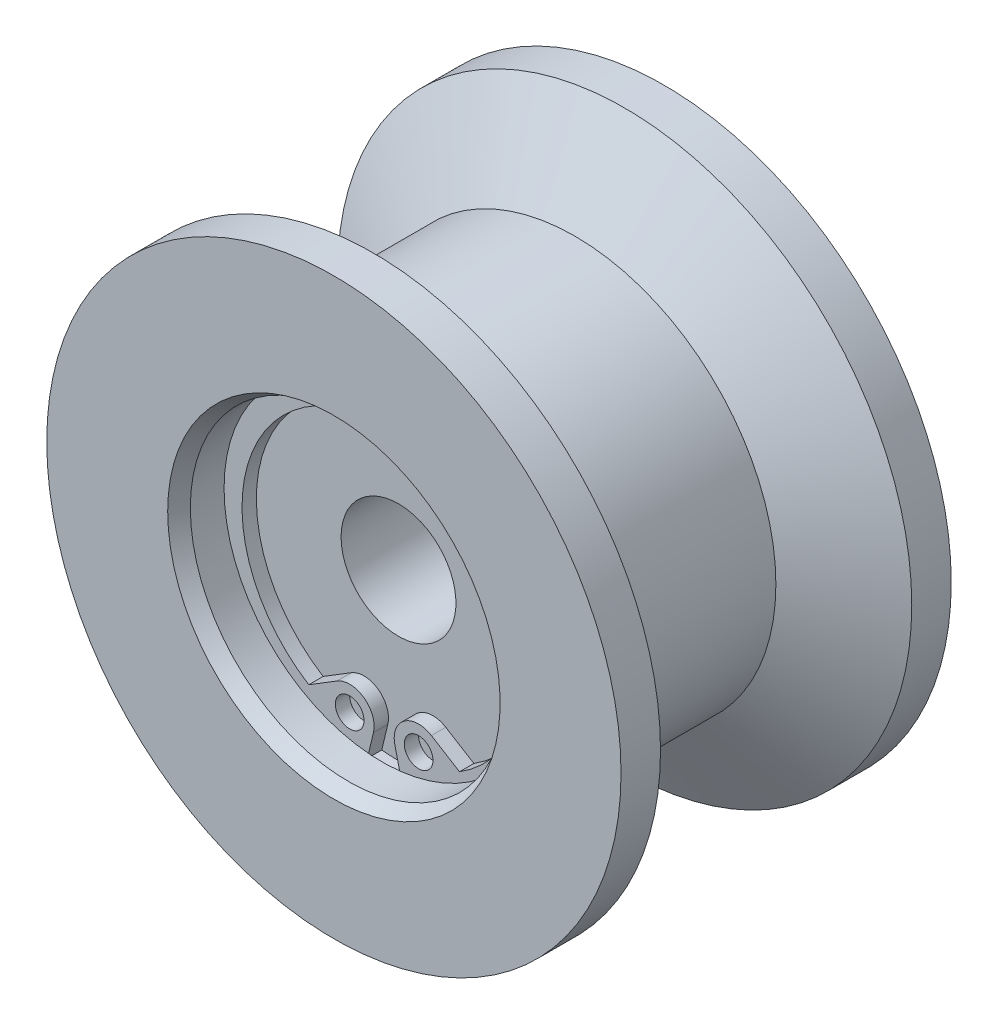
ISO-10303-21;
HEADER;
FILE_DESCRIPTION(('STEP AP214'),'2;1');
FILE_NAME('part.step','',(''),(''),'','','');
FILE_SCHEMA(('AUTOMOTIVE_DESIGN { 1 0 10303 214 1 1 1 1 }'));
ENDSEC;
DATA;
#1=APPLICATION_CONTEXT('core data for automotive mechanical design processes');
#2=APPLICATION_PROTOCOL_DEFINITION('international standard','automotive_design',2000,#1);
#3=PRODUCT_CONTEXT('',#1,'mechanical');
#4=PRODUCT('Part','Part','',(#3));
#5=PRODUCT_RELATED_PRODUCT_CATEGORY('part','',(#4));
#6=PRODUCT_DEFINITION_FORMATION('','',#4);
#7=PRODUCT_DEFINITION_CONTEXT('part definition',#1,'design');
#8=PRODUCT_DEFINITION('design','',#6,#7);
#9=PRODUCT_DEFINITION_SHAPE('','',#8);
#10=(LENGTH_UNIT() NAMED_UNIT(*) SI_UNIT(.MILLI.,.METRE.));
#11=(NAMED_UNIT(*) PLANE_ANGLE_UNIT() SI_UNIT($,.RADIAN.));
#12=(NAMED_UNIT(*) SI_UNIT($,.STERADIAN.) SOLID_ANGLE_UNIT());
#13=UNCERTAINTY_MEASURE_WITH_UNIT(LENGTH_MEASURE(1.E-05),#10,'distance_accuracy_value','');
#14=(GEOMETRIC_REPRESENTATION_CONTEXT(3) GLOBAL_UNCERTAINTY_ASSIGNED_CONTEXT((#13)) GLOBAL_UNIT_ASSIGNED_CONTEXT((#10,
#11,#12)) REPRESENTATION_CONTEXT('',''));
#15=CARTESIAN_POINT('',(0.,0.,0.));
#16=DIRECTION('',(0.,0.,1.));
#17=DIRECTION('',(1.,0.,0.));
#18=AXIS2_PLACEMENT_3D('',#15,#16,#17);
#19=CARTESIAN_POINT('',(0.,-0.65,8.));
#20=DIRECTION('',(0.,0.,1.));
#21=DIRECTION('',(-1.,0.,0.));
#22=AXIS2_PLACEMENT_3D('',#19,#20,#21);
#23=CYLINDRICAL_SURFACE('',#22,9.9);
#24=CARTESIAN_POINT('',(0.,-0.65,7.));
#25=DIRECTION('',(0.,0.,1.));
#26=DIRECTION('',(1.,0.,0.));
#27=AXIS2_PLACEMENT_3D('',#24,#25,#26);
#28=CIRCLE('',#27,9.9);
#29=CARTESIAN_POINT('',(5.24892182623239,-9.04397520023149,7.));
#30=VERTEX_POINT('',#29);
#31=CARTESIAN_POINT('',(-5.24892182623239,-9.04397520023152,7.));
#32=VERTEX_POINT('',#31);
#33=EDGE_CURVE('E169',#30,#32,#28,.T.);
#34=ORIENTED_EDGE('',*,*,#33,.F.);
#35=DIRECTION('',(0.,0.,-1.));
#36=VECTOR('',#35,1.);
#37=CARTESIAN_POINT('',(5.2489218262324,-9.04397520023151,8.));
#38=LINE('',#37,#36);
#39=CARTESIAN_POINT('',(5.2489218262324,-9.04397520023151,8.));
#40=VERTEX_POINT('',#39);
#41=EDGE_CURVE('E123',#40,#30,#38,.T.);
#42=ORIENTED_EDGE('',*,*,#41,.F.);
#43=CARTESIAN_POINT('',(0.,-0.65,8.));
#44=DIRECTION('',(0.,0.,-1.));
#45=DIRECTION('',(0.,-1.,0.));
#46=AXIS2_PLACEMENT_3D('',#43,#44,#45);
#47=CIRCLE('',#46,9.9);
#48=CARTESIAN_POINT('',(-5.24892182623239,-9.04397520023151,8.));
#49=VERTEX_POINT('',#48);
#50=EDGE_CURVE('E113',#49,#40,#47,.T.);
#51=ORIENTED_EDGE('',*,*,#50,.F.);
#52=DIRECTION('',(0.,0.,-1.));
#53=VECTOR('',#52,1.);
#54=CARTESIAN_POINT('',(-5.24892182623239,-9.04397520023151,8.));
#55=LINE('',#54,#53);
#56=EDGE_CURVE('E120',#49,#32,#55,.T.);
#57=ORIENTED_EDGE('',*,*,#56,.T.);
#58=EDGE_LOOP('',(#34,#42,#51,#57));
#59=FACE_BOUND('',#58,.T.);
#60=ADVANCED_FACE('F14',(#59),#23,.F.);
#61=CARTESIAN_POINT('',(3.29136923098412,-7.83857489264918,8.));
#62=DIRECTION('',(-0.524334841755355,-0.851512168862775,0.));
#63=DIRECTION('',(-0.851512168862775,0.524334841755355,0.));
#64=AXIS2_PLACEMENT_3D('',#61,#62,#63);
#65=PLANE('',#64);
#66=DIRECTION('',(0.851512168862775,-0.524334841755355,0.));
#67=VECTOR('',#66,1.);
#68=CARTESIAN_POINT('',(-4.38077094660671,-3.11430840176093,7.));
#69=LINE('',#68,#67);
#70=CARTESIAN_POINT('',(3.29136923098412,-7.83857489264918,7.));
#71=VERTEX_POINT('',#70);
#72=EDGE_CURVE('E144',#71,#30,#69,.T.);
#73=ORIENTED_EDGE('',*,*,#72,.F.);
#74=DIRECTION('',(0.,0.,-1.));
#75=VECTOR('',#74,1.);
#76=CARTESIAN_POINT('',(3.29136923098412,-7.83857489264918,8.));
#77=LINE('',#76,#75);
#78=CARTESIAN_POINT('',(3.29136923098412,-7.83857489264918,8.));
#79=VERTEX_POINT('',#78);
#80=EDGE_CURVE('E100',#79,#71,#77,.T.);
#81=ORIENTED_EDGE('',*,*,#80,.F.);
#82=DIRECTION('',(-0.851512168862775,0.524334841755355,0.));
#83=VECTOR('',#82,1.);
#84=CARTESIAN_POINT('',(3.29136923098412,-7.83857489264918,8.));
#85=LINE('',#84,#83);
#86=EDGE_CURVE('E106',#40,#79,#85,.T.);
#87=ORIENTED_EDGE('',*,*,#86,.F.);
#88=ORIENTED_EDGE('',*,*,#41,.T.);
#89=EDGE_LOOP('',(#73,#81,#87,#88));
#90=FACE_BOUND('',#89,.T.);
#91=ADVANCED_FACE('F172',(#90),#65,.F.);
#92=CARTESIAN_POINT('',(2.4,-9.28614557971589,8.));
#93=DIRECTION('',(0.,0.,1.));
#94=DIRECTION('',(-1.,0.,0.));
#95=AXIS2_PLACEMENT_3D('',#92,#93,#94);
#96=CYLINDRICAL_SURFACE('',#95,1.7);
#97=CARTESIAN_POINT('',(2.4,-9.28614557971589,7.));
#98=DIRECTION('',(0.,0.,1.));
#99=DIRECTION('',(1.,0.,0.));
#100=AXIS2_PLACEMENT_3D('',#97,#98,#99);
#101=CIRCLE('',#100,1.7);
#102=CARTESIAN_POINT('',(0.746119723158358,-9.67943940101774,7.));
#103=VERTEX_POINT('',#102);
#104=EDGE_CURVE('E134',#71,#103,#101,.T.);
#105=ORIENTED_EDGE('',*,*,#104,.T.);
#106=DIRECTION('',(0.,0.,-1.));
#107=VECTOR('',#106,1.);
#108=CARTESIAN_POINT('',(0.746119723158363,-9.67943940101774,8.));
#109=LINE('',#108,#107);
#110=CARTESIAN_POINT('',(0.746119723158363,-9.67943940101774,8.));
#111=VERTEX_POINT('',#110);
#112=EDGE_CURVE('E94',#111,#103,#109,.T.);
#113=ORIENTED_EDGE('',*,*,#112,.F.);
#114=CARTESIAN_POINT('',(2.4,-9.28614557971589,8.));
#115=DIRECTION('',(0.,0.,1.));
#116=DIRECTION('',(1.,0.,0.));
#117=AXIS2_PLACEMENT_3D('',#114,#115,#116);
#118=CIRCLE('',#117,1.7);
#119=EDGE_CURVE('E110',#79,#111,#118,.T.);
#120=ORIENTED_EDGE('',*,*,#119,.F.);
#121=ORIENTED_EDGE('',*,*,#80,.T.);
#122=EDGE_LOOP('',(#105,#113,#120,#121));
#123=FACE_BOUND('',#122,.T.);
#124=ADVANCED_FACE('F188',(#123),#96,.T.);
#125=CARTESIAN_POINT('',(-0.746119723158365,-9.67943940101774,8.));
#126=DIRECTION('',(-0.97287075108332,0.231349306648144,0.));
#127=DIRECTION('',(0.,0.,1.));
#128=AXIS2_PLACEMENT_3D('',#125,#126,#127);
#129=PLANE('',#128);
#130=DIRECTION('',(0.,0.,-1.));
#131=VECTOR('',#130,1.);
#132=CARTESIAN_POINT('',(-1.16498191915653,-11.440839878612,-11.5));
#133=LINE('',#132,#131);
#134=CARTESIAN_POINT('',(-1.16498191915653,-11.440839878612,7.));
#135=VERTEX_POINT('',#134);
#136=CARTESIAN_POINT('',(-1.16498191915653,-11.440839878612,8.));
#137=VERTEX_POINT('',#136);
#138=EDGE_CURVE('E127',#135,#137,#133,.F.);
#139=ORIENTED_EDGE('',*,*,#138,.F.);
#140=DIRECTION('',(-0.231349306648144,-0.97287075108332,0.));
#141=VECTOR('',#140,1.);
#142=CARTESIAN_POINT('',(2.37268657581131,3.43577356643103,7.));
#143=LINE('',#142,#141);
#144=CARTESIAN_POINT('',(-0.746119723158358,-9.67943940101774,7.));
#145=VERTEX_POINT('',#144);
#146=EDGE_CURVE('E92',#145,#135,#143,.T.);
#147=ORIENTED_EDGE('',*,*,#146,.F.);
#148=DIRECTION('',(0.,0.,-1.));
#149=VECTOR('',#148,1.);
#150=CARTESIAN_POINT('',(-0.746119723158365,-9.67943940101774,8.));
#151=LINE('',#150,#149);
#152=CARTESIAN_POINT('',(-0.746119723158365,-9.67943940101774,8.));
#153=VERTEX_POINT('',#152);
#154=EDGE_CURVE('E83',#153,#145,#151,.T.);
#155=ORIENTED_EDGE('',*,*,#154,.F.);
#156=DIRECTION('',(0.231349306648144,0.97287075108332,0.));
#157=VECTOR('',#156,1.);
#158=CARTESIAN_POINT('',(-0.746119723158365,-9.67943940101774,8.));
#159=LINE('',#158,#157);
#160=EDGE_CURVE('E68',#137,#153,#159,.T.);
#161=ORIENTED_EDGE('',*,*,#160,.F.);
#162=EDGE_LOOP('',(#139,#147,#155,#161));
#163=FACE_BOUND('',#162,.T.);
#164=ADVANCED_FACE('F90',(#163),#129,.F.);
#165=CARTESIAN_POINT('',(0.,-0.65,8.));
#166=DIRECTION('',(0.,0.,-1.));
#167=DIRECTION('',(0.,-1.,0.));
#168=AXIS2_PLACEMENT_3D('',#165,#166,#167);
#169=PLANE('',#168);
#170=CARTESIAN_POINT('',(2.4,-9.28614557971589,8.));
#171=DIRECTION('',(0.,0.,1.));
#172=DIRECTION('',(1.,0.,0.));
#173=AXIS2_PLACEMENT_3D('',#170,#171,#172);
#174=CIRCLE('',#173,1.);
#175=CARTESIAN_POINT('',(3.4,-9.28614557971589,8.));
#176=VERTEX_POINT('',#175);
#177=EDGE_CURVE('E95',#176,#176,#174,.T.);
#178=ORIENTED_EDGE('',*,*,#177,.F.);
#179=EDGE_LOOP('',(#178));
#180=FACE_BOUND('',#179,.T.);
#181=CARTESIAN_POINT('',(-2.4,-9.28614557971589,8.));
#182=DIRECTION('',(0.,0.,-1.));
#183=DIRECTION('',(1.,0.,0.));
#184=AXIS2_PLACEMENT_3D('',#181,#182,#183);
#185=CIRCLE('',#184,1.);
#186=CARTESIAN_POINT('',(-1.4,-9.28614557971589,8.));
#187=VERTEX_POINT('',#186);
#188=EDGE_CURVE('E87',#187,#187,#185,.T.);
#189=ORIENTED_EDGE('',*,*,#188,.T.);
#190=EDGE_LOOP('',(#189));
#191=FACE_BOUND('',#190,.T.);
#192=CARTESIAN_POINT('',(0.,0.,8.));
#193=DIRECTION('',(0.,0.,-1.));
#194=DIRECTION('',(-1.,0.,0.));
#195=AXIS2_PLACEMENT_3D('',#192,#193,#194);
#196=CIRCLE('',#195,11.5);
#197=CARTESIAN_POINT('',(1.16498191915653,-11.440839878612,8.));
#198=VERTEX_POINT('',#197);
#199=EDGE_CURVE('E23',#137,#198,#196,.T.);
#200=ORIENTED_EDGE('',*,*,#199,.F.);
#201=ORIENTED_EDGE('',*,*,#160,.T.);
#202=CARTESIAN_POINT('',(-2.4,-9.28614557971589,8.));
#203=DIRECTION('',(0.,0.,1.));
#204=DIRECTION('',(-1.,0.,0.));
#205=AXIS2_PLACEMENT_3D('',#202,#203,#204);
#206=CIRCLE('',#205,1.7);
#207=CARTESIAN_POINT('',(-3.29136923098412,-7.83857489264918,8.));
#208=VERTEX_POINT('',#207);
#209=EDGE_CURVE('E71',#153,#208,#206,.T.);
#210=ORIENTED_EDGE('',*,*,#209,.T.);
#211=DIRECTION('',(-0.851512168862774,-0.524334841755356,0.));
#212=VECTOR('',#211,1.);
#213=CARTESIAN_POINT('',(-3.29136923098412,-7.83857489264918,8.));
#214=LINE('',#213,#212);
#215=EDGE_CURVE('E116',#208,#49,#214,.T.);
#216=ORIENTED_EDGE('',*,*,#215,.T.);
#217=ORIENTED_EDGE('',*,*,#50,.T.);
#218=ORIENTED_EDGE('',*,*,#86,.T.);
#219=ORIENTED_EDGE('',*,*,#119,.T.);
#220=DIRECTION('',(0.231349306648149,-0.972870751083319,0.));
#221=VECTOR('',#220,1.);
#222=CARTESIAN_POINT('',(0.746119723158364,-9.67943940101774,8.));
#223=LINE('',#222,#221);
#224=EDGE_CURVE('E59',#111,#198,#223,.T.);
#225=ORIENTED_EDGE('',*,*,#224,.T.);
#226=EDGE_LOOP('',(#200,#201,#210,#216,#217,#218,#219,#225));
#227=FACE_BOUND('',#226,.T.);
#228=ADVANCED_FACE('F70',(#180,#191,#227),#169,.F.);
#229=CARTESIAN_POINT('',(2.4,-9.28614557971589,8.));
#230=DIRECTION('',(0.,0.,1.));
#231=DIRECTION('',(-1.,0.,0.));
#232=AXIS2_PLACEMENT_3D('',#229,#230,#231);
#233=CYLINDRICAL_SURFACE('',#232,1.);
#234=CARTESIAN_POINT('',(2.4,-9.28614557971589,7.));
#235=DIRECTION('',(0.,0.,1.));
#236=DIRECTION('',(1.,0.,0.));
#237=AXIS2_PLACEMENT_3D('',#234,#235,#236);
#238=CIRCLE('',#237,1.);
#239=CARTESIAN_POINT('',(3.4,-9.28614557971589,7.));
#240=VERTEX_POINT('',#239);
#241=EDGE_CURVE('E247',#240,#240,#238,.T.);
#242=ORIENTED_EDGE('',*,*,#241,.F.);
#243=EDGE_LOOP('',(#242));
#244=FACE_BOUND('',#243,.T.);
#245=ORIENTED_EDGE('',*,*,#177,.T.);
#246=EDGE_LOOP('',(#245));
#247=FACE_BOUND('',#246,.T.);
#248=ADVANCED_FACE('F280',(#244,#247),#233,.F.);
#249=CARTESIAN_POINT('',(-2.4,-9.28614557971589,8.));
#250=DIRECTION('',(0.,0.,1.));
#251=DIRECTION('',(-1.,0.,0.));
#252=AXIS2_PLACEMENT_3D('',#249,#250,#251);
#253=CYLINDRICAL_SURFACE('',#252,1.);
#254=CARTESIAN_POINT('',(-2.4,-9.28614557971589,7.));
#255=DIRECTION('',(0.,0.,1.));
#256=DIRECTION('',(1.,0.,0.));
#257=AXIS2_PLACEMENT_3D('',#254,#255,#256);
#258=CIRCLE('',#257,1.);
#259=CARTESIAN_POINT('',(-1.4,-9.28614557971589,7.));
#260=VERTEX_POINT('',#259);
#261=EDGE_CURVE('E250',#260,#260,#258,.T.);
#262=ORIENTED_EDGE('',*,*,#261,.F.);
#263=EDGE_LOOP('',(#262));
#264=FACE_BOUND('',#263,.T.);
#265=ORIENTED_EDGE('',*,*,#188,.F.);
#266=EDGE_LOOP('',(#265));
#267=FACE_BOUND('',#266,.T.);
#268=ADVANCED_FACE('F277',(#264,#267),#253,.F.);
#269=CARTESIAN_POINT('',(-3.29136923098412,-7.83857489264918,8.));
#270=DIRECTION('',(0.524334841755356,-0.851512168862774,0.));
#271=DIRECTION('',(0.,0.,-1.));
#272=AXIS2_PLACEMENT_3D('',#269,#270,#271);
#273=PLANE('',#272);
#274=DIRECTION('',(0.851512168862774,0.524334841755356,0.));
#275=VECTOR('',#274,1.);
#276=CARTESIAN_POINT('',(4.38077094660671,-3.11430840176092,7.));
#277=LINE('',#276,#275);
#278=CARTESIAN_POINT('',(-3.29136923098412,-7.83857489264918,7.));
#279=VERTEX_POINT('',#278);
#280=EDGE_CURVE('E163',#32,#279,#277,.T.);
#281=ORIENTED_EDGE('',*,*,#280,.F.);
#282=ORIENTED_EDGE('',*,*,#56,.F.);
#283=ORIENTED_EDGE('',*,*,#215,.F.);
#284=DIRECTION('',(0.,0.,-1.));
#285=VECTOR('',#284,1.);
#286=CARTESIAN_POINT('',(-3.29136923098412,-7.83857489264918,8.));
#287=LINE('',#286,#285);
#288=EDGE_CURVE('E85',#208,#279,#287,.T.);
#289=ORIENTED_EDGE('',*,*,#288,.T.);
#290=EDGE_LOOP('',(#281,#282,#283,#289));
#291=FACE_BOUND('',#290,.T.);
#292=ADVANCED_FACE('F16',(#291),#273,.F.);
#293=CARTESIAN_POINT('',(-2.4,-9.28614557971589,8.));
#294=DIRECTION('',(0.,0.,1.));
#295=DIRECTION('',(-1.,0.,0.));
#296=AXIS2_PLACEMENT_3D('',#293,#294,#295);
#297=CYLINDRICAL_SURFACE('',#296,1.7);
#298=CARTESIAN_POINT('',(-2.4,-9.28614557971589,7.));
#299=DIRECTION('',(0.,0.,1.));
#300=DIRECTION('',(1.,0.,0.));
#301=AXIS2_PLACEMENT_3D('',#298,#299,#300);
#302=CIRCLE('',#301,1.7);
#303=EDGE_CURVE('E210',#145,#279,#302,.T.);
#304=ORIENTED_EDGE('',*,*,#303,.T.);
#305=ORIENTED_EDGE('',*,*,#288,.F.);
#306=ORIENTED_EDGE('',*,*,#209,.F.);
#307=ORIENTED_EDGE('',*,*,#154,.T.);
#308=EDGE_LOOP('',(#304,#305,#306,#307));
#309=FACE_BOUND('',#308,.T.);
#310=ADVANCED_FACE('F81',(#309),#297,.T.);
#311=CARTESIAN_POINT('',(0.746119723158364,-9.67943940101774,8.));
#312=DIRECTION('',(0.972870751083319,0.231349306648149,0.));
#313=DIRECTION('',(0.,0.,-1.));
#314=AXIS2_PLACEMENT_3D('',#311,#312,#313);
#315=PLANE('',#314);
#316=DIRECTION('',(0.,0.,-1.));
#317=VECTOR('',#316,1.);
#318=CARTESIAN_POINT('',(1.16498191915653,-11.440839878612,-11.5));
#319=LINE('',#318,#317);
#320=CARTESIAN_POINT('',(1.16498191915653,-11.440839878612,7.));
#321=VERTEX_POINT('',#320);
#322=EDGE_CURVE('E9',#198,#321,#319,.T.);
#323=ORIENTED_EDGE('',*,*,#322,.F.);
#324=ORIENTED_EDGE('',*,*,#224,.F.);
#325=ORIENTED_EDGE('',*,*,#112,.T.);
#326=DIRECTION('',(-0.231349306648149,0.972870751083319,0.));
#327=VECTOR('',#326,1.);
#328=CARTESIAN_POINT('',(-2.37268657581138,3.435773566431,7.));
#329=LINE('',#328,#327);
#330=EDGE_CURVE('E128',#321,#103,#329,.T.);
#331=ORIENTED_EDGE('',*,*,#330,.F.);
#332=EDGE_LOOP('',(#323,#324,#325,#331));
#333=FACE_BOUND('',#332,.T.);
#334=ADVANCED_FACE('F190',(#333),#315,.F.);
#335=CARTESIAN_POINT('',(0.,4.,7.));
#336=DIRECTION('',(0.,0.,1.));
#337=DIRECTION('',(1.,0.,0.));
#338=AXIS2_PLACEMENT_3D('',#335,#336,#337);
#339=PLANE('',#338);
#340=ORIENTED_EDGE('',*,*,#241,.T.);
#341=EDGE_LOOP('',(#340));
#342=FACE_BOUND('',#341,.T.);
#343=ADVANCED_FACE('F297',(#342),#339,.T.);
#344=ORIENTED_EDGE('',*,*,#261,.T.);
#345=EDGE_LOOP('',(#344));
#346=FACE_BOUND('',#345,.T.);
#347=ADVANCED_FACE('F275',(#346),#339,.T.);
#348=CARTESIAN_POINT('',(0.,0.,-11.5));
#349=DIRECTION('',(0.,0.,-1.));
#350=DIRECTION('',(-1.,0.,0.));
#351=AXIS2_PLACEMENT_3D('',#348,#349,#350);
#352=CYLINDRICAL_SURFACE('',#351,14.);
#353=CARTESIAN_POINT('',(0.,0.,5.28589838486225));
#354=DIRECTION('',(0.,0.,-1.));
#355=DIRECTION('',(-1.,0.,0.));
#356=AXIS2_PLACEMENT_3D('',#353,#354,#355);
#357=CIRCLE('',#356,14.);
#358=CARTESIAN_POINT('',(-14.,0.,5.28589838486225));
#359=VERTEX_POINT('',#358);
#360=EDGE_CURVE('E238',#359,#359,#357,.T.);
#361=ORIENTED_EDGE('',*,*,#360,.T.);
#362=EDGE_LOOP('',(#361));
#363=FACE_BOUND('',#362,.T.);
#364=CARTESIAN_POINT('',(0.,0.,-5.28589838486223));
#365=DIRECTION('',(0.,0.,-1.));
#366=DIRECTION('',(-1.,0.,0.));
#367=AXIS2_PLACEMENT_3D('',#364,#365,#366);
#368=CIRCLE('',#367,14.);
#369=CARTESIAN_POINT('',(-14.,0.,-5.28589838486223));
#370=VERTEX_POINT('',#369);
#371=EDGE_CURVE('E241',#370,#370,#368,.T.);
#372=ORIENTED_EDGE('',*,*,#371,.F.);
#373=EDGE_LOOP('',(#372));
#374=FACE_BOUND('',#373,.T.);
#375=ADVANCED_FACE('F305',(#363,#374),#352,.T.);
#376=CARTESIAN_POINT('',(0.,0.,5.28589838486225));
#377=DIRECTION('',(0.,0.,1.));
#378=DIRECTION('',(1.,0.,0.));
#379=AXIS2_PLACEMENT_3D('',#376,#377,#378);
#380=CONICAL_SURFACE('',#379,14.,1.0471975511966);
#381=CARTESIAN_POINT('',(0.,0.,8.75));
#382=DIRECTION('',(0.,0.,-1.));
#383=DIRECTION('',(-1.,0.,0.));
#384=AXIS2_PLACEMENT_3D('',#381,#382,#383);
#385=CIRCLE('',#384,20.);
#386=CARTESIAN_POINT('',(-20.,0.,8.75));
#387=VERTEX_POINT('',#386);
#388=EDGE_CURVE('E235',#387,#387,#385,.T.);
#389=ORIENTED_EDGE('',*,*,#388,.T.);
#390=EDGE_LOOP('',(#389));
#391=FACE_BOUND('',#390,.T.);
#392=ORIENTED_EDGE('',*,*,#360,.F.);
#393=EDGE_LOOP('',(#392));
#394=FACE_BOUND('',#393,.T.);
#395=ADVANCED_FACE('F401',(#391,#394),#380,.T.);
#396=CARTESIAN_POINT('',(0.,0.,-8.75));
#397=DIRECTION('',(0.,0.,-1.));
#398=DIRECTION('',(-1.,0.,0.));
#399=AXIS2_PLACEMENT_3D('',#396,#397,#398);
#400=CONICAL_SURFACE('',#399,20.,1.0471975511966);
#401=ORIENTED_EDGE('',*,*,#371,.T.);
#402=EDGE_LOOP('',(#401));
#403=FACE_BOUND('',#402,.T.);
#404=CARTESIAN_POINT('',(0.,0.,-8.75));
#405=DIRECTION('',(0.,0.,-1.));
#406=DIRECTION('',(-1.,0.,0.));
#407=AXIS2_PLACEMENT_3D('',#404,#405,#406);
#408=CIRCLE('',#407,20.);
#409=CARTESIAN_POINT('',(-20.,0.,-8.75));
#410=VERTEX_POINT('',#409);
#411=EDGE_CURVE('E244',#410,#410,#408,.T.);
#412=ORIENTED_EDGE('',*,*,#411,.F.);
#413=EDGE_LOOP('',(#412));
#414=FACE_BOUND('',#413,.T.);
#415=ADVANCED_FACE('F411',(#403,#414),#400,.T.);
#416=CARTESIAN_POINT('',(0.,0.,-11.5));
#417=DIRECTION('',(0.,0.,-1.));
#418=DIRECTION('',(-1.,0.,0.));
#419=AXIS2_PLACEMENT_3D('',#416,#417,#418);
#420=CYLINDRICAL_SURFACE('',#419,20.);
#421=CARTESIAN_POINT('',(0.,0.,11.5));
#422=DIRECTION('',(0.,0.,-1.));
#423=DIRECTION('',(-1.,0.,0.));
#424=AXIS2_PLACEMENT_3D('',#421,#422,#423);
#425=CIRCLE('',#424,20.);
#426=CARTESIAN_POINT('',(-20.,0.,11.5));
#427=VERTEX_POINT('',#426);
#428=EDGE_CURVE('E232',#427,#427,#425,.T.);
#429=ORIENTED_EDGE('',*,*,#428,.T.);
#430=EDGE_LOOP('',(#429));
#431=FACE_BOUND('',#430,.T.);
#432=ORIENTED_EDGE('',*,*,#388,.F.);
#433=EDGE_LOOP('',(#432));
#434=FACE_BOUND('',#433,.T.);
#435=ADVANCED_FACE('F421',(#431,#434),#420,.T.);
#436=CARTESIAN_POINT('',(0.,0.,-11.5));
#437=DIRECTION('',(0.,0.,-1.));
#438=DIRECTION('',(-1.,0.,0.));
#439=AXIS2_PLACEMENT_3D('',#436,#437,#438);
#440=CYLINDRICAL_SURFACE('',#439,20.);
#441=ORIENTED_EDGE('',*,*,#411,.T.);
#442=EDGE_LOOP('',(#441));
#443=FACE_BOUND('',#442,.T.);
#444=CARTESIAN_POINT('',(0.,0.,-11.5));
#445=DIRECTION('',(0.,0.,-1.));
#446=DIRECTION('',(-1.,0.,0.));
#447=AXIS2_PLACEMENT_3D('',#444,#445,#446);
#448=CIRCLE('',#447,20.);
#449=CARTESIAN_POINT('',(-20.,0.,-11.5));
#450=VERTEX_POINT('',#449);
#451=EDGE_CURVE('E119',#450,#450,#448,.T.);
#452=ORIENTED_EDGE('',*,*,#451,.F.);
#453=EDGE_LOOP('',(#452));
#454=FACE_BOUND('',#453,.T.);
#455=ADVANCED_FACE('F317',(#443,#454),#440,.T.);
#456=CARTESIAN_POINT('',(0.,20.,11.5));
#457=DIRECTION('',(0.,0.,1.));
#458=DIRECTION('',(1.,0.,0.));
#459=AXIS2_PLACEMENT_3D('',#456,#457,#458);
#460=PLANE('',#459);
#461=CARTESIAN_POINT('',(0.,0.,11.5));
#462=DIRECTION('',(0.,0.,-1.));
#463=DIRECTION('',(-1.,0.,0.));
#464=AXIS2_PLACEMENT_3D('',#461,#462,#463);
#465=CIRCLE('',#464,11.5773502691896);
#466=CARTESIAN_POINT('',(-11.5773502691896,0.,11.5));
#467=VERTEX_POINT('',#466);
#468=EDGE_CURVE('E229',#467,#467,#465,.T.);
#469=ORIENTED_EDGE('',*,*,#468,.T.);
#470=EDGE_LOOP('',(#469));
#471=FACE_BOUND('',#470,.T.);
#472=ORIENTED_EDGE('',*,*,#428,.F.);
#473=EDGE_LOOP('',(#472));
#474=FACE_BOUND('',#473,.T.);
#475=ADVANCED_FACE('F439',(#471,#474),#460,.T.);
#476=CARTESIAN_POINT('',(0.,9.,-11.5));
#477=DIRECTION('',(0.,0.,-1.));
#478=DIRECTION('',(-1.,0.,0.));
#479=AXIS2_PLACEMENT_3D('',#476,#477,#478);
#480=PLANE('',#479);
#481=ORIENTED_EDGE('',*,*,#451,.T.);
#482=EDGE_LOOP('',(#481));
#483=FACE_BOUND('',#482,.T.);
#484=CARTESIAN_POINT('',(0.,0.,-11.5));
#485=DIRECTION('',(0.,0.,-1.));
#486=DIRECTION('',(-1.,0.,0.));
#487=AXIS2_PLACEMENT_3D('',#484,#485,#486);
#488=CIRCLE('',#487,9.);
#489=CARTESIAN_POINT('',(-9.,0.,-11.5));
#490=VERTEX_POINT('',#489);
#491=EDGE_CURVE('E601',#490,#490,#488,.T.);
#492=ORIENTED_EDGE('',*,*,#491,.F.);
#493=EDGE_LOOP('',(#492));
#494=FACE_BOUND('',#493,.T.);
#495=ADVANCED_FACE('F448',(#483,#494),#480,.T.);
#496=CARTESIAN_POINT('',(0.,0.,11.5));
#497=DIRECTION('',(0.,0.,1.));
#498=DIRECTION('',(1.,0.,0.));
#499=AXIS2_PLACEMENT_3D('',#496,#497,#498);
#500=CONICAL_SURFACE('',#499,11.5773502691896,0.523598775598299);
#501=CARTESIAN_POINT('',(0.,0.,10.5));
#502=DIRECTION('',(0.,0.,-1.));
#503=DIRECTION('',(-1.,0.,0.));
#504=AXIS2_PLACEMENT_3D('',#501,#502,#503);
#505=CIRCLE('',#504,11.);
#506=CARTESIAN_POINT('',(-11.,0.,10.5));
#507=VERTEX_POINT('',#506);
#508=EDGE_CURVE('E226',#507,#507,#505,.T.);
#509=ORIENTED_EDGE('',*,*,#508,.T.);
#510=EDGE_LOOP('',(#509));
#511=FACE_BOUND('',#510,.T.);
#512=ORIENTED_EDGE('',*,*,#468,.F.);
#513=EDGE_LOOP('',(#512));
#514=FACE_BOUND('',#513,.T.);
#515=ADVANCED_FACE('F458',(#511,#514),#500,.F.);
#516=CARTESIAN_POINT('',(0.,0.,-11.5));
#517=DIRECTION('',(0.,0.,-1.));
#518=DIRECTION('',(-1.,0.,0.));
#519=AXIS2_PLACEMENT_3D('',#516,#517,#518);
#520=CYLINDRICAL_SURFACE('',#519,9.);
#521=ORIENTED_EDGE('',*,*,#491,.T.);
#522=EDGE_LOOP('',(#521));
#523=FACE_BOUND('',#522,.T.);
#524=CARTESIAN_POINT('',(0.,0.,-7.));
#525=DIRECTION('',(0.,0.,-1.));
#526=DIRECTION('',(-1.,0.,0.));
#527=AXIS2_PLACEMENT_3D('',#524,#525,#526);
#528=CIRCLE('',#527,9.);
#529=CARTESIAN_POINT('',(-9.,0.,-7.));
#530=VERTEX_POINT('',#529);
#531=EDGE_CURVE('E599',#530,#530,#528,.T.);
#532=ORIENTED_EDGE('',*,*,#531,.F.);
#533=EDGE_LOOP('',(#532));
#534=FACE_BOUND('',#533,.T.);
#535=ADVANCED_FACE('F468',(#523,#534),#520,.F.);
#536=CARTESIAN_POINT('',(0.,0.,-11.5));
#537=DIRECTION('',(0.,0.,-1.));
#538=DIRECTION('',(-1.,0.,0.));
#539=AXIS2_PLACEMENT_3D('',#536,#537,#538);
#540=CYLINDRICAL_SURFACE('',#539,11.);
#541=CARTESIAN_POINT('',(0.,0.,8.15));
#542=DIRECTION('',(0.,0.,-1.));
#543=DIRECTION('',(-1.,0.,0.));
#544=AXIS2_PLACEMENT_3D('',#541,#542,#543);
#545=CIRCLE('',#544,11.);
#546=CARTESIAN_POINT('',(-11.,0.,8.15));
#547=VERTEX_POINT('',#546);
#548=EDGE_CURVE('E217',#547,#547,#545,.T.);
#549=ORIENTED_EDGE('',*,*,#548,.T.);
#550=EDGE_LOOP('',(#549));
#551=FACE_BOUND('',#550,.T.);
#552=ORIENTED_EDGE('',*,*,#508,.F.);
#553=EDGE_LOOP('',(#552));
#554=FACE_BOUND('',#553,.T.);
#555=ADVANCED_FACE('F478',(#551,#554),#540,.F.);
#556=CARTESIAN_POINT('',(0.,9.,-7.));
#557=DIRECTION('',(0.,0.,-1.));
#558=DIRECTION('',(-1.,0.,0.));
#559=AXIS2_PLACEMENT_3D('',#556,#557,#558);
#560=PLANE('',#559);
#561=ORIENTED_EDGE('',*,*,#531,.T.);
#562=EDGE_LOOP('',(#561));
#563=FACE_BOUND('',#562,.T.);
#564=CARTESIAN_POINT('',(0.,0.,-7.));
#565=DIRECTION('',(0.,0.,-1.));
#566=DIRECTION('',(-1.,0.,0.));
#567=AXIS2_PLACEMENT_3D('',#564,#565,#566);
#568=CIRCLE('',#567,4.);
#569=CARTESIAN_POINT('',(-4.,0.,-7.));
#570=VERTEX_POINT('',#569);
#571=EDGE_CURVE('E220',#570,#570,#568,.T.);
#572=ORIENTED_EDGE('',*,*,#571,.F.);
#573=EDGE_LOOP('',(#572));
#574=FACE_BOUND('',#573,.T.);
#575=ADVANCED_FACE('F488',(#563,#574),#560,.T.);
#576=CARTESIAN_POINT('',(0.,11.5,8.15));
#577=DIRECTION('',(0.,0.,-1.));
#578=DIRECTION('',(-1.,0.,0.));
#579=AXIS2_PLACEMENT_3D('',#576,#577,#578);
#580=PLANE('',#579);
#581=CARTESIAN_POINT('',(0.,0.,8.15));
#582=DIRECTION('',(0.,0.,-1.));
#583=DIRECTION('',(-1.,0.,0.));
#584=AXIS2_PLACEMENT_3D('',#581,#582,#583);
#585=CIRCLE('',#584,11.5);
#586=CARTESIAN_POINT('',(-11.5,0.,8.15));
#587=VERTEX_POINT('',#586);
#588=EDGE_CURVE('E213',#587,#587,#585,.T.);
#589=ORIENTED_EDGE('',*,*,#588,.T.);
#590=EDGE_LOOP('',(#589));
#591=FACE_BOUND('',#590,.T.);
#592=ORIENTED_EDGE('',*,*,#548,.F.);
#593=EDGE_LOOP('',(#592));
#594=FACE_BOUND('',#593,.T.);
#595=ADVANCED_FACE('F498',(#591,#594),#580,.T.);
#596=CARTESIAN_POINT('',(0.,0.,-11.5));
#597=DIRECTION('',(0.,0.,-1.));
#598=DIRECTION('',(-1.,0.,0.));
#599=AXIS2_PLACEMENT_3D('',#596,#597,#598);
#600=CYLINDRICAL_SURFACE('',#599,11.5);
#601=ORIENTED_EDGE('',*,*,#588,.F.);
#602=EDGE_LOOP('',(#601));
#603=FACE_BOUND('',#602,.T.);
#604=ORIENTED_EDGE('',*,*,#199,.T.);
#605=ORIENTED_EDGE('',*,*,#322,.T.);
#606=CARTESIAN_POINT('',(0.,0.,7.));
#607=DIRECTION('',(0.,0.,-1.));
#608=DIRECTION('',(-1.,0.,0.));
#609=AXIS2_PLACEMENT_3D('',#606,#607,#608);
#610=CIRCLE('',#609,11.5);
#611=EDGE_CURVE('E209',#321,#135,#610,.T.);
#612=ORIENTED_EDGE('',*,*,#611,.T.);
#613=ORIENTED_EDGE('',*,*,#138,.T.);
#614=EDGE_LOOP('',(#604,#605,#612,#613));
#615=FACE_BOUND('',#614,.T.);
#616=ADVANCED_FACE('F212',(#603,#615),#600,.F.);
#617=CARTESIAN_POINT('',(0.,0.,-11.5));
#618=DIRECTION('',(0.,0.,-1.));
#619=DIRECTION('',(-1.,0.,0.));
#620=AXIS2_PLACEMENT_3D('',#617,#618,#619);
#621=CYLINDRICAL_SURFACE('',#620,4.);
#622=ORIENTED_EDGE('',*,*,#571,.T.);
#623=EDGE_LOOP('',(#622));
#624=FACE_BOUND('',#623,.T.);
#625=CARTESIAN_POINT('',(0.,0.,7.));
#626=DIRECTION('',(0.,0.,-1.));
#627=DIRECTION('',(-1.,0.,0.));
#628=AXIS2_PLACEMENT_3D('',#625,#626,#627);
#629=CIRCLE('',#628,4.);
#630=CARTESIAN_POINT('',(-4.,0.,7.));
#631=VERTEX_POINT('',#630);
#632=EDGE_CURVE('E214',#631,#631,#629,.T.);
#633=ORIENTED_EDGE('',*,*,#632,.F.);
#634=EDGE_LOOP('',(#633));
#635=FACE_BOUND('',#634,.T.);
#636=ADVANCED_FACE('F309',(#624,#635),#621,.F.);
#637=ORIENTED_EDGE('',*,*,#632,.T.);
#638=EDGE_LOOP('',(#637));
#639=FACE_BOUND('',#638,.T.);
#640=ORIENTED_EDGE('',*,*,#611,.F.);
#641=ORIENTED_EDGE('',*,*,#330,.T.);
#642=ORIENTED_EDGE('',*,*,#104,.F.);
#643=ORIENTED_EDGE('',*,*,#72,.T.);
#644=ORIENTED_EDGE('',*,*,#33,.T.);
#645=ORIENTED_EDGE('',*,*,#280,.T.);
#646=ORIENTED_EDGE('',*,*,#303,.F.);
#647=ORIENTED_EDGE('',*,*,#146,.T.);
#648=EDGE_LOOP('',(#640,#641,#642,#643,#644,#645,#646,#647));
#649=FACE_BOUND('',#648,.T.);
#650=ADVANCED_FACE('F208',(#639,#649),#339,.T.);
#651=CLOSED_SHELL('',(#60,#91,#124,#164,#228,#248,#268,#292,#310,#334,#343,#347,#375,#395,#415,
#435,#455,#475,#495,#515,#535,#555,#575,#595,#616,#636,#650));
#652=MANIFOLD_SOLID_BREP('B1',#651);
#653=ADVANCED_BREP_SHAPE_REPRESENTATION('',(#18,#652),#14);
#654=SHAPE_DEFINITION_REPRESENTATION(#9,#653);
ENDSEC;
END-ISO-10303-21;
